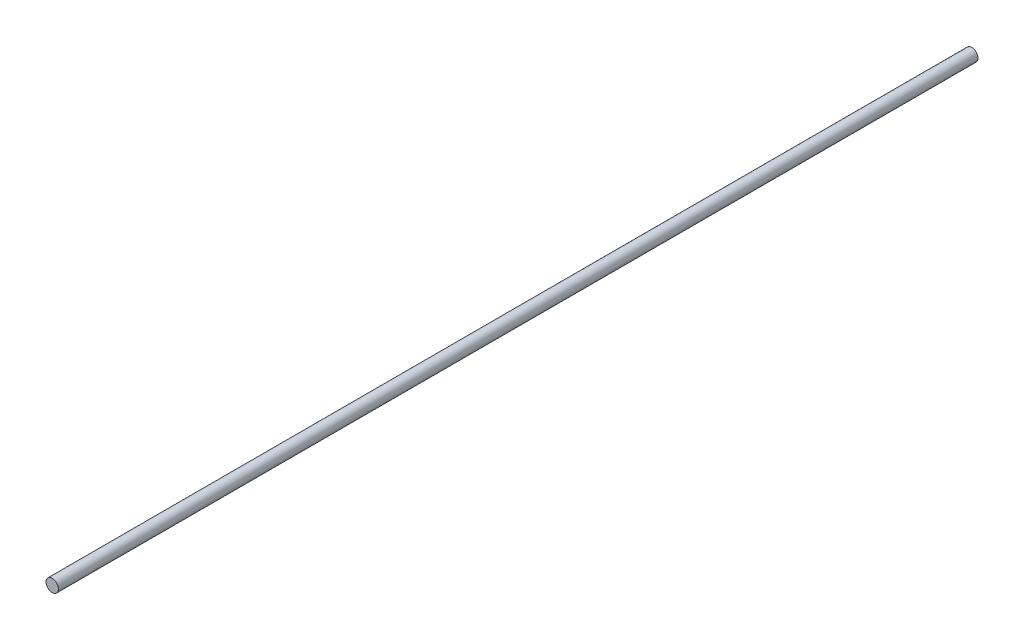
from build123d import *

# Parameters (mm, degrees)
SKETCH1_R           = 30
BOSS_EXTRUDE1_DEPTH = 4450


with BuildPart() as part:
    # Sketch1 → Boss-Extrude1 (new body)
    with BuildSketch(Plane.XY):
        Circle(SKETCH1_R)
    extrude(amount=-BOSS_EXTRUDE1_DEPTH)


solid = part.part
